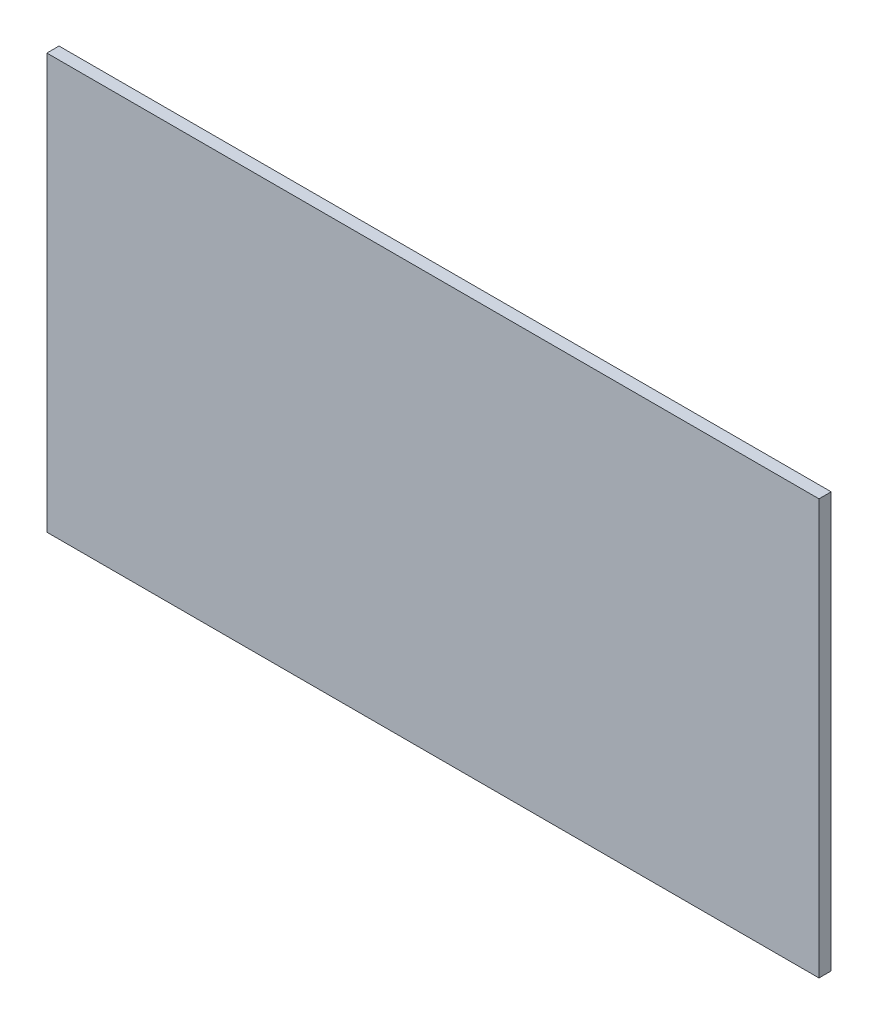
from build123d import *

# Parameters (mm, degrees)
SKETCH_1_W      = 12.691062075
SKETCH_1_H      = 6.820932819
EXTRUDE_1_DEPTH = 0.2


with BuildPart() as part:
    # Sketch 1 → Extrude 1 (new body)
    with BuildSketch(Plane.XY):
        with Locations((6.345531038, 3.41046641)):
            Rectangle(SKETCH_1_W, SKETCH_1_H)
    extrude(amount=EXTRUDE_1_DEPTH)


solid = part.part
